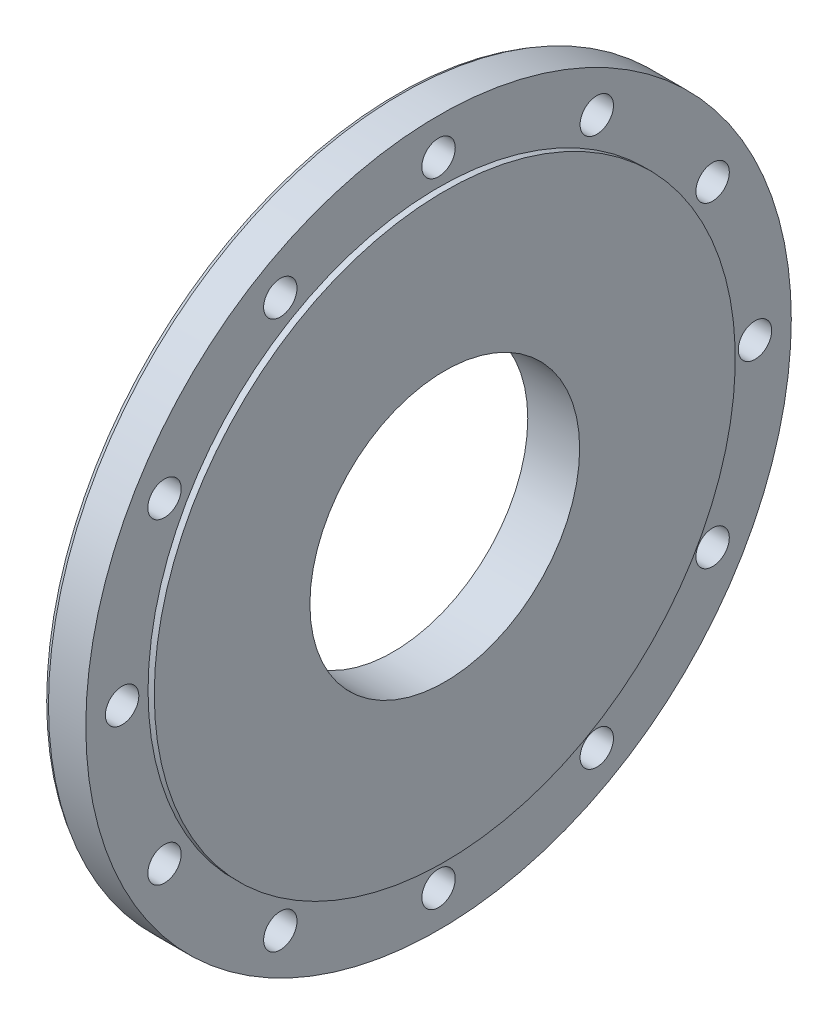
ISO-10303-21;
HEADER;
FILE_DESCRIPTION(('STEP AP214'),'2;1');
FILE_NAME('part.step','',(''),(''),'','','');
FILE_SCHEMA(('AUTOMOTIVE_DESIGN { 1 0 10303 214 1 1 1 1 }'));
ENDSEC;
DATA;
#1=APPLICATION_CONTEXT('core data for automotive mechanical design processes');
#2=APPLICATION_PROTOCOL_DEFINITION('international standard','automotive_design',2000,#1);
#3=PRODUCT_CONTEXT('',#1,'mechanical');
#4=PRODUCT('Part','Part','',(#3));
#5=PRODUCT_RELATED_PRODUCT_CATEGORY('part','',(#4));
#6=PRODUCT_DEFINITION_FORMATION('','',#4);
#7=PRODUCT_DEFINITION_CONTEXT('part definition',#1,'design');
#8=PRODUCT_DEFINITION('design','',#6,#7);
#9=PRODUCT_DEFINITION_SHAPE('','',#8);
#10=(LENGTH_UNIT() NAMED_UNIT(*) SI_UNIT(.MILLI.,.METRE.));
#11=(NAMED_UNIT(*) PLANE_ANGLE_UNIT() SI_UNIT($,.RADIAN.));
#12=(NAMED_UNIT(*) SI_UNIT($,.STERADIAN.) SOLID_ANGLE_UNIT());
#13=UNCERTAINTY_MEASURE_WITH_UNIT(LENGTH_MEASURE(1.E-05),#10,'distance_accuracy_value','');
#14=(GEOMETRIC_REPRESENTATION_CONTEXT(3) GLOBAL_UNCERTAINTY_ASSIGNED_CONTEXT((#13)) GLOBAL_UNIT_ASSIGNED_CONTEXT((#10,
#11,#12)) REPRESENTATION_CONTEXT('',''));
#15=CARTESIAN_POINT('',(0.,0.,0.));
#16=DIRECTION('',(0.,0.,1.));
#17=DIRECTION('',(1.,0.,0.));
#18=AXIS2_PLACEMENT_3D('',#15,#16,#17);
#19=CARTESIAN_POINT('',(0.,0.,0.));
#20=DIRECTION('',(-1.,0.,0.));
#21=DIRECTION('',(0.,0.,1.));
#22=AXIS2_PLACEMENT_3D('',#19,#20,#21);
#23=CYLINDRICAL_SURFACE('',#22,65.);
#24=CARTESIAN_POINT('',(25.,0.,0.));
#25=DIRECTION('',(-1.,0.,0.));
#26=DIRECTION('',(0.,0.,1.));
#27=AXIS2_PLACEMENT_3D('',#24,#25,#26);
#28=CIRCLE('',#27,65.);
#29=CARTESIAN_POINT('',(25.,0.,65.));
#30=VERTEX_POINT('',#29);
#31=EDGE_CURVE('E60',#30,#30,#28,.T.);
#32=ORIENTED_EDGE('',*,*,#31,.F.);
#33=EDGE_LOOP('',(#32));
#34=FACE_BOUND('',#33,.T.);
#35=CARTESIAN_POINT('',(0.,0.,0.));
#36=DIRECTION('',(-1.,0.,0.));
#37=DIRECTION('',(0.,0.,1.));
#38=AXIS2_PLACEMENT_3D('',#35,#36,#37);
#39=CIRCLE('',#38,65.);
#40=CARTESIAN_POINT('',(0.,0.,65.));
#41=VERTEX_POINT('',#40);
#42=EDGE_CURVE('E39',#41,#41,#39,.T.);
#43=ORIENTED_EDGE('',*,*,#42,.T.);
#44=EDGE_LOOP('',(#43));
#45=FACE_BOUND('',#44,.T.);
#46=ADVANCED_FACE('F29',(#34,#45),#23,.F.);
#47=CARTESIAN_POINT('',(0.,65.,0.));
#48=DIRECTION('',(1.,0.,0.));
#49=DIRECTION('',(0.,0.,-1.));
#50=AXIS2_PLACEMENT_3D('',#47,#48,#49);
#51=PLANE('',#50);
#52=ORIENTED_EDGE('',*,*,#42,.F.);
#53=EDGE_LOOP('',(#52));
#54=FACE_BOUND('',#53,.T.);
#55=CARTESIAN_POINT('',(0.,0.,0.));
#56=DIRECTION('',(-1.,0.,0.));
#57=DIRECTION('',(0.,0.,1.));
#58=AXIS2_PLACEMENT_3D('',#55,#56,#57);
#59=CIRCLE('',#58,130.);
#60=CARTESIAN_POINT('',(0.,0.,130.));
#61=VERTEX_POINT('',#60);
#62=EDGE_CURVE('E43',#61,#61,#59,.T.);
#63=ORIENTED_EDGE('',*,*,#62,.T.);
#64=EDGE_LOOP('',(#63));
#65=FACE_BOUND('',#64,.T.);
#66=ADVANCED_FACE('F185',(#54,#65),#51,.F.);
#67=CARTESIAN_POINT('',(0.,0.,0.));
#68=DIRECTION('',(-1.,0.,0.));
#69=DIRECTION('',(0.,0.,1.));
#70=AXIS2_PLACEMENT_3D('',#67,#68,#69);
#71=CYLINDRICAL_SURFACE('',#70,130.);
#72=ORIENTED_EDGE('',*,*,#62,.F.);
#73=EDGE_LOOP('',(#72));
#74=FACE_BOUND('',#73,.T.);
#75=CARTESIAN_POINT('',(2.,0.,0.));
#76=DIRECTION('',(-1.,0.,0.));
#77=DIRECTION('',(0.,0.,1.));
#78=AXIS2_PLACEMENT_3D('',#75,#76,#77);
#79=CIRCLE('',#78,130.);
#80=CARTESIAN_POINT('',(2.,0.,130.));
#81=VERTEX_POINT('',#80);
#82=EDGE_CURVE('E48',#81,#81,#79,.T.);
#83=ORIENTED_EDGE('',*,*,#82,.T.);
#84=EDGE_LOOP('',(#83));
#85=FACE_BOUND('',#84,.T.);
#86=ADVANCED_FACE('F190',(#74,#85),#71,.T.);
#87=CARTESIAN_POINT('',(2.,130.,0.));
#88=DIRECTION('',(1.,0.,0.));
#89=DIRECTION('',(0.,0.,-1.));
#90=AXIS2_PLACEMENT_3D('',#87,#88,#89);
#91=PLANE('',#90);
#92=CARTESIAN_POINT('',(2.,132.068874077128,76.2499999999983));
#93=DIRECTION('',(1.,0.,0.));
#94=DIRECTION('',(0.,0.,-1.));
#95=AXIS2_PLACEMENT_3D('',#92,#93,#94);
#96=CIRCLE('',#95,8.05);
#97=CARTESIAN_POINT('',(2.,132.068874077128,68.1999999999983));
#98=VERTEX_POINT('',#97);
#99=EDGE_CURVE('E129',#98,#98,#96,.T.);
#100=ORIENTED_EDGE('',*,*,#99,.T.);
#101=EDGE_LOOP('',(#100));
#102=FACE_BOUND('',#101,.T.);
#103=CARTESIAN_POINT('',(2.,76.2500000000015,132.068874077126));
#104=DIRECTION('',(1.,0.,0.));
#105=DIRECTION('',(0.,0.,-1.));
#106=AXIS2_PLACEMENT_3D('',#103,#104,#105);
#107=CIRCLE('',#106,8.05);
#108=CARTESIAN_POINT('',(2.,76.2500000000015,124.018874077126));
#109=VERTEX_POINT('',#108);
#110=EDGE_CURVE('E123',#109,#109,#107,.T.);
#111=ORIENTED_EDGE('',*,*,#110,.T.);
#112=EDGE_LOOP('',(#111));
#113=FACE_BOUND('',#112,.T.);
#114=CARTESIAN_POINT('',(2.,1.59735363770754E-12,152.5));
#115=DIRECTION('',(1.,0.,0.));
#116=DIRECTION('',(0.,0.,-1.));
#117=AXIS2_PLACEMENT_3D('',#114,#115,#116);
#118=CIRCLE('',#117,8.05);
#119=CARTESIAN_POINT('',(2.,1.59735363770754E-12,144.45));
#120=VERTEX_POINT('',#119);
#121=EDGE_CURVE('E117',#120,#120,#118,.T.);
#122=ORIENTED_EDGE('',*,*,#121,.T.);
#123=EDGE_LOOP('',(#122));
#124=FACE_BOUND('',#123,.T.);
#125=CARTESIAN_POINT('',(2.,-76.2499999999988,132.068874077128));
#126=DIRECTION('',(1.,0.,0.));
#127=DIRECTION('',(0.,0.,-1.));
#128=AXIS2_PLACEMENT_3D('',#125,#126,#127);
#129=CIRCLE('',#128,8.05000000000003);
#130=CARTESIAN_POINT('',(2.,-76.2499999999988,124.018874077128));
#131=VERTEX_POINT('',#130);
#132=EDGE_CURVE('E111',#131,#131,#129,.T.);
#133=ORIENTED_EDGE('',*,*,#132,.T.);
#134=EDGE_LOOP('',(#133));
#135=FACE_BOUND('',#134,.T.);
#136=CARTESIAN_POINT('',(2.,-132.068874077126,76.2500000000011));
#137=DIRECTION('',(1.,0.,0.));
#138=DIRECTION('',(0.,0.,-1.));
#139=AXIS2_PLACEMENT_3D('',#136,#137,#138);
#140=CIRCLE('',#139,8.05);
#141=CARTESIAN_POINT('',(2.,-132.068874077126,68.2000000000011));
#142=VERTEX_POINT('',#141);
#143=EDGE_CURVE('E105',#142,#142,#140,.T.);
#144=ORIENTED_EDGE('',*,*,#143,.T.);
#145=EDGE_LOOP('',(#144));
#146=FACE_BOUND('',#145,.T.);
#147=CARTESIAN_POINT('',(2.,-152.5,1.06490242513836E-12));
#148=DIRECTION('',(1.,0.,0.));
#149=DIRECTION('',(0.,0.,-1.));
#150=AXIS2_PLACEMENT_3D('',#147,#148,#149);
#151=CIRCLE('',#150,8.05);
#152=CARTESIAN_POINT('',(2.,-152.5,-8.04999999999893));
#153=VERTEX_POINT('',#152);
#154=EDGE_CURVE('E99',#153,#153,#151,.T.);
#155=ORIENTED_EDGE('',*,*,#154,.T.);
#156=EDGE_LOOP('',(#155));
#157=FACE_BOUND('',#156,.T.);
#158=CARTESIAN_POINT('',(2.,-132.068874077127,-76.2499999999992));
#159=DIRECTION('',(1.,0.,0.));
#160=DIRECTION('',(0.,0.,-1.));
#161=AXIS2_PLACEMENT_3D('',#158,#159,#160);
#162=CIRCLE('',#161,8.04999999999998);
#163=CARTESIAN_POINT('',(2.,-132.068874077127,-84.2999999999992));
#164=VERTEX_POINT('',#163);
#165=EDGE_CURVE('E93',#164,#164,#162,.T.);
#166=ORIENTED_EDGE('',*,*,#165,.T.);
#167=EDGE_LOOP('',(#166));
#168=FACE_BOUND('',#167,.T.);
#169=CARTESIAN_POINT('',(2.,-76.2500000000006,-132.068874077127));
#170=DIRECTION('',(1.,0.,0.));
#171=DIRECTION('',(0.,0.,-1.));
#172=AXIS2_PLACEMENT_3D('',#169,#170,#171);
#173=CIRCLE('',#172,8.05);
#174=CARTESIAN_POINT('',(2.,-76.2500000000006,-140.118874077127));
#175=VERTEX_POINT('',#174);
#176=EDGE_CURVE('E87',#175,#175,#173,.T.);
#177=ORIENTED_EDGE('',*,*,#176,.T.);
#178=EDGE_LOOP('',(#177));
#179=FACE_BOUND('',#178,.T.);
#180=CARTESIAN_POINT('',(2.,-5.32451212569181E-13,-152.5));
#181=DIRECTION('',(1.,0.,0.));
#182=DIRECTION('',(0.,0.,-1.));
#183=AXIS2_PLACEMENT_3D('',#180,#181,#182);
#184=CIRCLE('',#183,8.05);
#185=CARTESIAN_POINT('',(2.,-5.32451212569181E-13,-160.55));
#186=VERTEX_POINT('',#185);
#187=EDGE_CURVE('E81',#186,#186,#184,.T.);
#188=ORIENTED_EDGE('',*,*,#187,.T.);
#189=EDGE_LOOP('',(#188));
#190=FACE_BOUND('',#189,.T.);
#191=CARTESIAN_POINT('',(2.,76.2499999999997,-132.068874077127));
#192=DIRECTION('',(1.,0.,0.));
#193=DIRECTION('',(0.,0.,-1.));
#194=AXIS2_PLACEMENT_3D('',#191,#192,#193);
#195=CIRCLE('',#194,8.04999999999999);
#196=CARTESIAN_POINT('',(2.,76.2499999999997,-140.118874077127));
#197=VERTEX_POINT('',#196);
#198=EDGE_CURVE('E75',#197,#197,#195,.T.);
#199=ORIENTED_EDGE('',*,*,#198,.T.);
#200=EDGE_LOOP('',(#199));
#201=FACE_BOUND('',#200,.T.);
#202=CARTESIAN_POINT('',(2.,132.068874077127,-76.2500000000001));
#203=DIRECTION('',(1.,0.,0.));
#204=DIRECTION('',(0.,0.,-1.));
#205=AXIS2_PLACEMENT_3D('',#202,#203,#204);
#206=CIRCLE('',#205,8.05);
#207=CARTESIAN_POINT('',(2.,132.068874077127,-84.3000000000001));
#208=VERTEX_POINT('',#207);
#209=EDGE_CURVE('E69',#208,#208,#206,.T.);
#210=ORIENTED_EDGE('',*,*,#209,.T.);
#211=EDGE_LOOP('',(#210));
#212=FACE_BOUND('',#211,.T.);
#213=CARTESIAN_POINT('',(2.,152.5,0.));
#214=DIRECTION('',(1.,0.,0.));
#215=DIRECTION('',(0.,0.,-1.));
#216=AXIS2_PLACEMENT_3D('',#213,#214,#215);
#217=CIRCLE('',#216,8.05);
#218=CARTESIAN_POINT('',(2.,152.5,-8.05));
#219=VERTEX_POINT('',#218);
#220=EDGE_CURVE('E63',#219,#219,#217,.T.);
#221=ORIENTED_EDGE('',*,*,#220,.T.);
#222=EDGE_LOOP('',(#221));
#223=FACE_BOUND('',#222,.T.);
#224=CARTESIAN_POINT('',(2.,0.,0.));
#225=DIRECTION('',(1.,0.,0.));
#226=DIRECTION('',(0.,0.,-1.));
#227=AXIS2_PLACEMENT_3D('',#224,#225,#226);
#228=CIRCLE('',#227,168.845299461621);
#229=CARTESIAN_POINT('',(2.,0.,-168.845299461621));
#230=VERTEX_POINT('',#229);
#231=EDGE_CURVE('E35',#230,#230,#228,.F.);
#232=ORIENTED_EDGE('',*,*,#231,.T.);
#233=EDGE_LOOP('',(#232));
#234=FACE_BOUND('',#233,.T.);
#235=ORIENTED_EDGE('',*,*,#82,.F.);
#236=EDGE_LOOP('',(#235));
#237=FACE_BOUND('',#236,.T.);
#238=ADVANCED_FACE('F195',(#102,#113,#124,#135,#146,#157,#168,#179,#190,#201,#212,#223,#234,
#237),#91,.F.);
#239=CARTESIAN_POINT('',(0.,0.,0.));
#240=DIRECTION('',(-1.,0.,0.));
#241=DIRECTION('',(0.,0.,1.));
#242=AXIS2_PLACEMENT_3D('',#239,#240,#241);
#243=CYLINDRICAL_SURFACE('',#242,170.);
#244=CARTESIAN_POINT('',(4.00000000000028,0.,0.));
#245=DIRECTION('',(1.,0.,0.));
#246=DIRECTION('',(0.,0.,-1.));
#247=AXIS2_PLACEMENT_3D('',#244,#245,#246);
#248=CIRCLE('',#247,170.);
#249=CARTESIAN_POINT('',(4.00000000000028,0.,-170.));
#250=VERTEX_POINT('',#249);
#251=EDGE_CURVE('E10',#250,#250,#248,.T.);
#252=ORIENTED_EDGE('',*,*,#251,.T.);
#253=EDGE_LOOP('',(#252));
#254=FACE_BOUND('',#253,.T.);
#255=CARTESIAN_POINT('',(22.,0.,0.));
#256=DIRECTION('',(-1.,0.,0.));
#257=DIRECTION('',(0.,0.,1.));
#258=AXIS2_PLACEMENT_3D('',#255,#256,#257);
#259=CIRCLE('',#258,170.);
#260=CARTESIAN_POINT('',(22.,0.,170.));
#261=VERTEX_POINT('',#260);
#262=EDGE_CURVE('E51',#261,#261,#259,.T.);
#263=ORIENTED_EDGE('',*,*,#262,.T.);
#264=EDGE_LOOP('',(#263));
#265=FACE_BOUND('',#264,.T.);
#266=ADVANCED_FACE('F143',(#254,#265),#243,.T.);
#267=CARTESIAN_POINT('',(22.,170.,0.));
#268=DIRECTION('',(-1.,0.,0.));
#269=DIRECTION('',(0.,0.,1.));
#270=AXIS2_PLACEMENT_3D('',#267,#268,#269);
#271=PLANE('',#270);
#272=CARTESIAN_POINT('',(22.,132.068874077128,76.2499999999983));
#273=DIRECTION('',(1.,0.,0.));
#274=DIRECTION('',(0.,0.,-1.));
#275=AXIS2_PLACEMENT_3D('',#272,#273,#274);
#276=CIRCLE('',#275,8.05);
#277=CARTESIAN_POINT('',(22.,132.068874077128,68.1999999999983));
#278=VERTEX_POINT('',#277);
#279=EDGE_CURVE('E132',#278,#278,#276,.T.);
#280=ORIENTED_EDGE('',*,*,#279,.F.);
#281=EDGE_LOOP('',(#280));
#282=FACE_BOUND('',#281,.T.);
#283=CARTESIAN_POINT('',(22.,76.2500000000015,132.068874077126));
#284=DIRECTION('',(1.,0.,0.));
#285=DIRECTION('',(0.,0.,-1.));
#286=AXIS2_PLACEMENT_3D('',#283,#284,#285);
#287=CIRCLE('',#286,8.05);
#288=CARTESIAN_POINT('',(22.,76.2500000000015,124.018874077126));
#289=VERTEX_POINT('',#288);
#290=EDGE_CURVE('E126',#289,#289,#287,.T.);
#291=ORIENTED_EDGE('',*,*,#290,.F.);
#292=EDGE_LOOP('',(#291));
#293=FACE_BOUND('',#292,.T.);
#294=CARTESIAN_POINT('',(22.,1.59735363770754E-12,152.5));
#295=DIRECTION('',(1.,0.,0.));
#296=DIRECTION('',(0.,0.,-1.));
#297=AXIS2_PLACEMENT_3D('',#294,#295,#296);
#298=CIRCLE('',#297,8.05);
#299=CARTESIAN_POINT('',(22.,1.59735363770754E-12,144.45));
#300=VERTEX_POINT('',#299);
#301=EDGE_CURVE('E120',#300,#300,#298,.T.);
#302=ORIENTED_EDGE('',*,*,#301,.F.);
#303=EDGE_LOOP('',(#302));
#304=FACE_BOUND('',#303,.T.);
#305=CARTESIAN_POINT('',(22.,-76.2499999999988,132.068874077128));
#306=DIRECTION('',(1.,0.,0.));
#307=DIRECTION('',(0.,0.,-1.));
#308=AXIS2_PLACEMENT_3D('',#305,#306,#307);
#309=CIRCLE('',#308,8.05000000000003);
#310=CARTESIAN_POINT('',(22.,-76.2499999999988,124.018874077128));
#311=VERTEX_POINT('',#310);
#312=EDGE_CURVE('E114',#311,#311,#309,.T.);
#313=ORIENTED_EDGE('',*,*,#312,.F.);
#314=EDGE_LOOP('',(#313));
#315=FACE_BOUND('',#314,.T.);
#316=CARTESIAN_POINT('',(22.,-132.068874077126,76.2500000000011));
#317=DIRECTION('',(1.,0.,0.));
#318=DIRECTION('',(0.,0.,-1.));
#319=AXIS2_PLACEMENT_3D('',#316,#317,#318);
#320=CIRCLE('',#319,8.05);
#321=CARTESIAN_POINT('',(22.,-132.068874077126,68.2000000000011));
#322=VERTEX_POINT('',#321);
#323=EDGE_CURVE('E108',#322,#322,#320,.T.);
#324=ORIENTED_EDGE('',*,*,#323,.F.);
#325=EDGE_LOOP('',(#324));
#326=FACE_BOUND('',#325,.T.);
#327=CARTESIAN_POINT('',(22.,-152.5,1.06490242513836E-12));
#328=DIRECTION('',(1.,0.,0.));
#329=DIRECTION('',(0.,0.,-1.));
#330=AXIS2_PLACEMENT_3D('',#327,#328,#329);
#331=CIRCLE('',#330,8.05);
#332=CARTESIAN_POINT('',(22.,-152.5,-8.04999999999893));
#333=VERTEX_POINT('',#332);
#334=EDGE_CURVE('E102',#333,#333,#331,.T.);
#335=ORIENTED_EDGE('',*,*,#334,.F.);
#336=EDGE_LOOP('',(#335));
#337=FACE_BOUND('',#336,.T.);
#338=CARTESIAN_POINT('',(22.,-132.068874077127,-76.2499999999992));
#339=DIRECTION('',(1.,0.,0.));
#340=DIRECTION('',(0.,0.,-1.));
#341=AXIS2_PLACEMENT_3D('',#338,#339,#340);
#342=CIRCLE('',#341,8.04999999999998);
#343=CARTESIAN_POINT('',(22.,-132.068874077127,-84.2999999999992));
#344=VERTEX_POINT('',#343);
#345=EDGE_CURVE('E96',#344,#344,#342,.T.);
#346=ORIENTED_EDGE('',*,*,#345,.F.);
#347=EDGE_LOOP('',(#346));
#348=FACE_BOUND('',#347,.T.);
#349=CARTESIAN_POINT('',(22.,-76.2500000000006,-132.068874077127));
#350=DIRECTION('',(1.,0.,0.));
#351=DIRECTION('',(0.,0.,-1.));
#352=AXIS2_PLACEMENT_3D('',#349,#350,#351);
#353=CIRCLE('',#352,8.05);
#354=CARTESIAN_POINT('',(22.,-76.2500000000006,-140.118874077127));
#355=VERTEX_POINT('',#354);
#356=EDGE_CURVE('E90',#355,#355,#353,.T.);
#357=ORIENTED_EDGE('',*,*,#356,.F.);
#358=EDGE_LOOP('',(#357));
#359=FACE_BOUND('',#358,.T.);
#360=CARTESIAN_POINT('',(22.,-5.32451212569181E-13,-152.5));
#361=DIRECTION('',(1.,0.,0.));
#362=DIRECTION('',(0.,0.,-1.));
#363=AXIS2_PLACEMENT_3D('',#360,#361,#362);
#364=CIRCLE('',#363,8.05);
#365=CARTESIAN_POINT('',(22.,-5.32451212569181E-13,-160.55));
#366=VERTEX_POINT('',#365);
#367=EDGE_CURVE('E84',#366,#366,#364,.T.);
#368=ORIENTED_EDGE('',*,*,#367,.F.);
#369=EDGE_LOOP('',(#368));
#370=FACE_BOUND('',#369,.T.);
#371=CARTESIAN_POINT('',(22.,76.2499999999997,-132.068874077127));
#372=DIRECTION('',(1.,0.,0.));
#373=DIRECTION('',(0.,0.,-1.));
#374=AXIS2_PLACEMENT_3D('',#371,#372,#373);
#375=CIRCLE('',#374,8.04999999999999);
#376=CARTESIAN_POINT('',(22.,76.2499999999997,-140.118874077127));
#377=VERTEX_POINT('',#376);
#378=EDGE_CURVE('E78',#377,#377,#375,.T.);
#379=ORIENTED_EDGE('',*,*,#378,.F.);
#380=EDGE_LOOP('',(#379));
#381=FACE_BOUND('',#380,.T.);
#382=CARTESIAN_POINT('',(22.,132.068874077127,-76.2500000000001));
#383=DIRECTION('',(1.,0.,0.));
#384=DIRECTION('',(0.,0.,-1.));
#385=AXIS2_PLACEMENT_3D('',#382,#383,#384);
#386=CIRCLE('',#385,8.05);
#387=CARTESIAN_POINT('',(22.,132.068874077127,-84.3000000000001));
#388=VERTEX_POINT('',#387);
#389=EDGE_CURVE('E72',#388,#388,#386,.T.);
#390=ORIENTED_EDGE('',*,*,#389,.F.);
#391=EDGE_LOOP('',(#390));
#392=FACE_BOUND('',#391,.T.);
#393=CARTESIAN_POINT('',(22.,152.5,0.));
#394=DIRECTION('',(1.,0.,0.));
#395=DIRECTION('',(0.,0.,-1.));
#396=AXIS2_PLACEMENT_3D('',#393,#394,#395);
#397=CIRCLE('',#396,8.05);
#398=CARTESIAN_POINT('',(22.,152.5,-8.05));
#399=VERTEX_POINT('',#398);
#400=EDGE_CURVE('E66',#399,#399,#397,.T.);
#401=ORIENTED_EDGE('',*,*,#400,.F.);
#402=EDGE_LOOP('',(#401));
#403=FACE_BOUND('',#402,.T.);
#404=ORIENTED_EDGE('',*,*,#262,.F.);
#405=EDGE_LOOP('',(#404));
#406=FACE_BOUND('',#405,.T.);
#407=CARTESIAN_POINT('',(22.,0.,0.));
#408=DIRECTION('',(-1.,0.,0.));
#409=DIRECTION('',(0.,0.,1.));
#410=AXIS2_PLACEMENT_3D('',#407,#408,#409);
#411=CIRCLE('',#410,140.);
#412=CARTESIAN_POINT('',(22.,0.,140.));
#413=VERTEX_POINT('',#412);
#414=EDGE_CURVE('E54',#413,#413,#411,.T.);
#415=ORIENTED_EDGE('',*,*,#414,.T.);
#416=EDGE_LOOP('',(#415));
#417=FACE_BOUND('',#416,.T.);
#418=ADVANCED_FACE('F139',(#282,#293,#304,#315,#326,#337,#348,#359,#370,#381,#392,#403,#406,
#417),#271,.F.);
#419=CARTESIAN_POINT('',(0.,0.,0.));
#420=DIRECTION('',(-1.,0.,0.));
#421=DIRECTION('',(0.,0.,1.));
#422=AXIS2_PLACEMENT_3D('',#419,#420,#421);
#423=CYLINDRICAL_SURFACE('',#422,140.);
#424=ORIENTED_EDGE('',*,*,#414,.F.);
#425=EDGE_LOOP('',(#424));
#426=FACE_BOUND('',#425,.T.);
#427=CARTESIAN_POINT('',(25.,0.,0.));
#428=DIRECTION('',(-1.,0.,0.));
#429=DIRECTION('',(0.,0.,1.));
#430=AXIS2_PLACEMENT_3D('',#427,#428,#429);
#431=CIRCLE('',#430,140.);
#432=CARTESIAN_POINT('',(25.,0.,140.));
#433=VERTEX_POINT('',#432);
#434=EDGE_CURVE('E57',#433,#433,#431,.T.);
#435=ORIENTED_EDGE('',*,*,#434,.T.);
#436=EDGE_LOOP('',(#435));
#437=FACE_BOUND('',#436,.T.);
#438=ADVANCED_FACE('F142',(#426,#437),#423,.T.);
#439=CARTESIAN_POINT('',(25.,140.,0.));
#440=DIRECTION('',(-1.,0.,0.));
#441=DIRECTION('',(0.,0.,1.));
#442=AXIS2_PLACEMENT_3D('',#439,#440,#441);
#443=PLANE('',#442);
#444=ORIENTED_EDGE('',*,*,#434,.F.);
#445=EDGE_LOOP('',(#444));
#446=FACE_BOUND('',#445,.T.);
#447=ORIENTED_EDGE('',*,*,#31,.T.);
#448=EDGE_LOOP('',(#447));
#449=FACE_BOUND('',#448,.T.);
#450=ADVANCED_FACE('F173',(#446,#449),#443,.F.);
#451=CARTESIAN_POINT('',(2.,0.,0.));
#452=DIRECTION('',(1.,0.,0.));
#453=DIRECTION('',(0.,0.,-1.));
#454=AXIS2_PLACEMENT_3D('',#451,#452,#453);
#455=CONICAL_SURFACE('',#454,168.845299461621,0.523598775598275);
#456=ORIENTED_EDGE('',*,*,#251,.F.);
#457=EDGE_LOOP('',(#456));
#458=FACE_BOUND('',#457,.T.);
#459=ORIENTED_EDGE('',*,*,#231,.F.);
#460=EDGE_LOOP('',(#459));
#461=FACE_BOUND('',#460,.T.);
#462=ADVANCED_FACE('F179',(#458,#461),#455,.T.);
#463=CARTESIAN_POINT('',(0.,152.5,0.));
#464=DIRECTION('',(1.,0.,0.));
#465=DIRECTION('',(0.,0.,-1.));
#466=AXIS2_PLACEMENT_3D('',#463,#464,#465);
#467=CYLINDRICAL_SURFACE('',#466,8.05);
#468=ORIENTED_EDGE('',*,*,#400,.T.);
#469=EDGE_LOOP('',(#468));
#470=FACE_BOUND('',#469,.T.);
#471=ORIENTED_EDGE('',*,*,#220,.F.);
#472=EDGE_LOOP('',(#471));
#473=FACE_BOUND('',#472,.T.);
#474=ADVANCED_FACE('F210',(#470,#473),#467,.F.);
#475=CARTESIAN_POINT('',(0.,132.068874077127,-76.2500000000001));
#476=DIRECTION('',(1.,0.,0.));
#477=DIRECTION('',(0.,0.,-1.));
#478=AXIS2_PLACEMENT_3D('',#475,#476,#477);
#479=CYLINDRICAL_SURFACE('',#478,8.05);
#480=ORIENTED_EDGE('',*,*,#389,.T.);
#481=EDGE_LOOP('',(#480));
#482=FACE_BOUND('',#481,.T.);
#483=ORIENTED_EDGE('',*,*,#209,.F.);
#484=EDGE_LOOP('',(#483));
#485=FACE_BOUND('',#484,.T.);
#486=ADVANCED_FACE('F214',(#482,#485),#479,.F.);
#487=CARTESIAN_POINT('',(0.,76.2499999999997,-132.068874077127));
#488=DIRECTION('',(1.,0.,0.));
#489=DIRECTION('',(0.,0.,-1.));
#490=AXIS2_PLACEMENT_3D('',#487,#488,#489);
#491=CYLINDRICAL_SURFACE('',#490,8.04999999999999);
#492=ORIENTED_EDGE('',*,*,#378,.T.);
#493=EDGE_LOOP('',(#492));
#494=FACE_BOUND('',#493,.T.);
#495=ORIENTED_EDGE('',*,*,#198,.F.);
#496=EDGE_LOOP('',(#495));
#497=FACE_BOUND('',#496,.T.);
#498=ADVANCED_FACE('F218',(#494,#497),#491,.F.);
#499=CARTESIAN_POINT('',(0.,-5.32451212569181E-13,-152.5));
#500=DIRECTION('',(1.,0.,0.));
#501=DIRECTION('',(0.,0.,-1.));
#502=AXIS2_PLACEMENT_3D('',#499,#500,#501);
#503=CYLINDRICAL_SURFACE('',#502,8.05);
#504=ORIENTED_EDGE('',*,*,#367,.T.);
#505=EDGE_LOOP('',(#504));
#506=FACE_BOUND('',#505,.T.);
#507=ORIENTED_EDGE('',*,*,#187,.F.);
#508=EDGE_LOOP('',(#507));
#509=FACE_BOUND('',#508,.T.);
#510=ADVANCED_FACE('F222',(#506,#509),#503,.F.);
#511=CARTESIAN_POINT('',(0.,-76.2500000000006,-132.068874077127));
#512=DIRECTION('',(1.,0.,0.));
#513=DIRECTION('',(0.,0.,-1.));
#514=AXIS2_PLACEMENT_3D('',#511,#512,#513);
#515=CYLINDRICAL_SURFACE('',#514,8.05);
#516=ORIENTED_EDGE('',*,*,#356,.T.);
#517=EDGE_LOOP('',(#516));
#518=FACE_BOUND('',#517,.T.);
#519=ORIENTED_EDGE('',*,*,#176,.F.);
#520=EDGE_LOOP('',(#519));
#521=FACE_BOUND('',#520,.T.);
#522=ADVANCED_FACE('F226',(#518,#521),#515,.F.);
#523=CARTESIAN_POINT('',(0.,-132.068874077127,-76.2499999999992));
#524=DIRECTION('',(1.,0.,0.));
#525=DIRECTION('',(0.,0.,-1.));
#526=AXIS2_PLACEMENT_3D('',#523,#524,#525);
#527=CYLINDRICAL_SURFACE('',#526,8.04999999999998);
#528=ORIENTED_EDGE('',*,*,#345,.T.);
#529=EDGE_LOOP('',(#528));
#530=FACE_BOUND('',#529,.T.);
#531=ORIENTED_EDGE('',*,*,#165,.F.);
#532=EDGE_LOOP('',(#531));
#533=FACE_BOUND('',#532,.T.);
#534=ADVANCED_FACE('F230',(#530,#533),#527,.F.);
#535=CARTESIAN_POINT('',(0.,-152.5,1.06490242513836E-12));
#536=DIRECTION('',(1.,0.,0.));
#537=DIRECTION('',(0.,0.,-1.));
#538=AXIS2_PLACEMENT_3D('',#535,#536,#537);
#539=CYLINDRICAL_SURFACE('',#538,8.05);
#540=ORIENTED_EDGE('',*,*,#334,.T.);
#541=EDGE_LOOP('',(#540));
#542=FACE_BOUND('',#541,.T.);
#543=ORIENTED_EDGE('',*,*,#154,.F.);
#544=EDGE_LOOP('',(#543));
#545=FACE_BOUND('',#544,.T.);
#546=ADVANCED_FACE('F234',(#542,#545),#539,.F.);
#547=CARTESIAN_POINT('',(0.,-132.068874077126,76.2500000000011));
#548=DIRECTION('',(1.,0.,0.));
#549=DIRECTION('',(0.,0.,-1.));
#550=AXIS2_PLACEMENT_3D('',#547,#548,#549);
#551=CYLINDRICAL_SURFACE('',#550,8.05);
#552=ORIENTED_EDGE('',*,*,#323,.T.);
#553=EDGE_LOOP('',(#552));
#554=FACE_BOUND('',#553,.T.);
#555=ORIENTED_EDGE('',*,*,#143,.F.);
#556=EDGE_LOOP('',(#555));
#557=FACE_BOUND('',#556,.T.);
#558=ADVANCED_FACE('F238',(#554,#557),#551,.F.);
#559=CARTESIAN_POINT('',(0.,-76.2499999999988,132.068874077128));
#560=DIRECTION('',(1.,0.,0.));
#561=DIRECTION('',(0.,0.,-1.));
#562=AXIS2_PLACEMENT_3D('',#559,#560,#561);
#563=CYLINDRICAL_SURFACE('',#562,8.05000000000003);
#564=ORIENTED_EDGE('',*,*,#312,.T.);
#565=EDGE_LOOP('',(#564));
#566=FACE_BOUND('',#565,.T.);
#567=ORIENTED_EDGE('',*,*,#132,.F.);
#568=EDGE_LOOP('',(#567));
#569=FACE_BOUND('',#568,.T.);
#570=ADVANCED_FACE('F242',(#566,#569),#563,.F.);
#571=CARTESIAN_POINT('',(0.,1.59735363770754E-12,152.5));
#572=DIRECTION('',(1.,0.,0.));
#573=DIRECTION('',(0.,0.,-1.));
#574=AXIS2_PLACEMENT_3D('',#571,#572,#573);
#575=CYLINDRICAL_SURFACE('',#574,8.05);
#576=ORIENTED_EDGE('',*,*,#301,.T.);
#577=EDGE_LOOP('',(#576));
#578=FACE_BOUND('',#577,.T.);
#579=ORIENTED_EDGE('',*,*,#121,.F.);
#580=EDGE_LOOP('',(#579));
#581=FACE_BOUND('',#580,.T.);
#582=ADVANCED_FACE('F246',(#578,#581),#575,.F.);
#583=CARTESIAN_POINT('',(0.,76.2500000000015,132.068874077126));
#584=DIRECTION('',(1.,0.,0.));
#585=DIRECTION('',(0.,0.,-1.));
#586=AXIS2_PLACEMENT_3D('',#583,#584,#585);
#587=CYLINDRICAL_SURFACE('',#586,8.05);
#588=ORIENTED_EDGE('',*,*,#290,.T.);
#589=EDGE_LOOP('',(#588));
#590=FACE_BOUND('',#589,.T.);
#591=ORIENTED_EDGE('',*,*,#110,.F.);
#592=EDGE_LOOP('',(#591));
#593=FACE_BOUND('',#592,.T.);
#594=ADVANCED_FACE('F250',(#590,#593),#587,.F.);
#595=CARTESIAN_POINT('',(0.,132.068874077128,76.2499999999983));
#596=DIRECTION('',(1.,0.,0.));
#597=DIRECTION('',(0.,0.,-1.));
#598=AXIS2_PLACEMENT_3D('',#595,#596,#597);
#599=CYLINDRICAL_SURFACE('',#598,8.05);
#600=ORIENTED_EDGE('',*,*,#279,.T.);
#601=EDGE_LOOP('',(#600));
#602=FACE_BOUND('',#601,.T.);
#603=ORIENTED_EDGE('',*,*,#99,.F.);
#604=EDGE_LOOP('',(#603));
#605=FACE_BOUND('',#604,.T.);
#606=ADVANCED_FACE('F136',(#602,#605),#599,.F.);
#607=CLOSED_SHELL('',(#46,#66,#86,#238,#266,#418,#438,#450,#462,#474,#486,#498,#510,#522,#534,
#546,#558,#570,#582,#594,#606));
#608=MANIFOLD_SOLID_BREP('B2',#607);
#609=ADVANCED_BREP_SHAPE_REPRESENTATION('',(#18,#608),#14);
#610=SHAPE_DEFINITION_REPRESENTATION(#9,#609);
ENDSEC;
END-ISO-10303-21;
